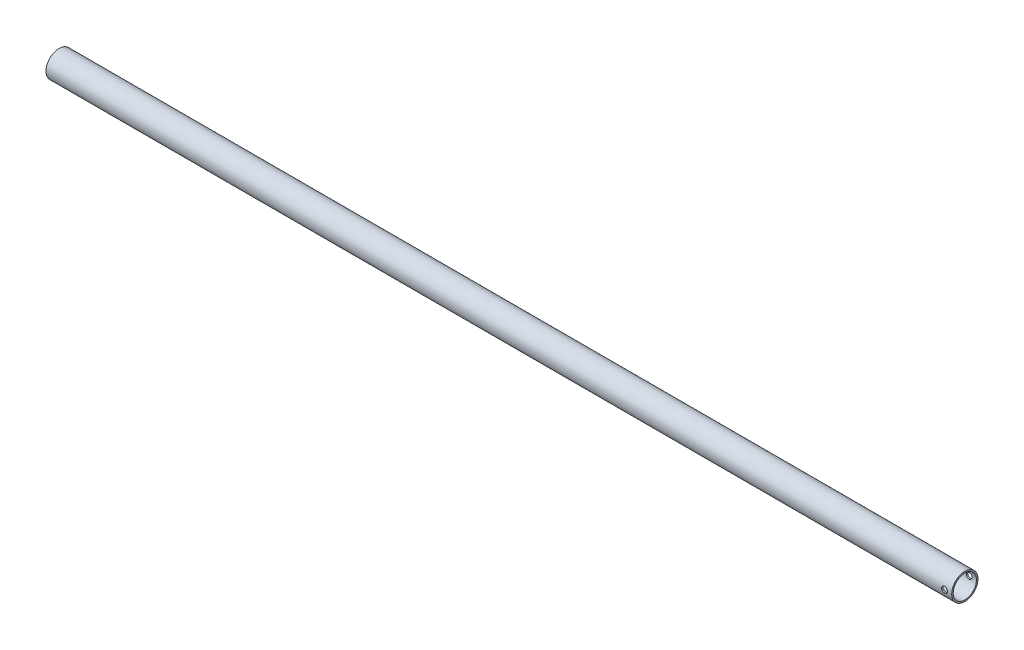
from build123d import *

# Parameters (mm, degrees)
SKETCH3_W          = 984.25
SKETCH3_H          = 1.651
SKETCH4_R          = 3.175
CUT_EXTRUDE2_DEPTH = 25.4


with BuildPart() as part:
    # Sketch3 → Revolve1 (revolve)
    with BuildSketch(Plane.XY, mode=Mode.PRIVATE) as revolve1_sk:
        with Locations((-492.125, 13.462)):
            Rectangle(SKETCH3_W, SKETCH3_H)
    revolve(revolve1_sk.sketch.rotate(Axis((0, 0, 0), (-1, 0, 0)), 90), axis=Axis((0, 0, 0), (-1, 0, 0)))

    # Sketch4 → Cut-Extrude2 (cut, symmetric)
    with BuildSketch(Plane.XY):
        with Locations((-7.9248, 0)):
            Circle(SKETCH4_R)
    extrude(amount=CUT_EXTRUDE2_DEPTH, both=True, mode=Mode.SUBTRACT)


solid = part.part
